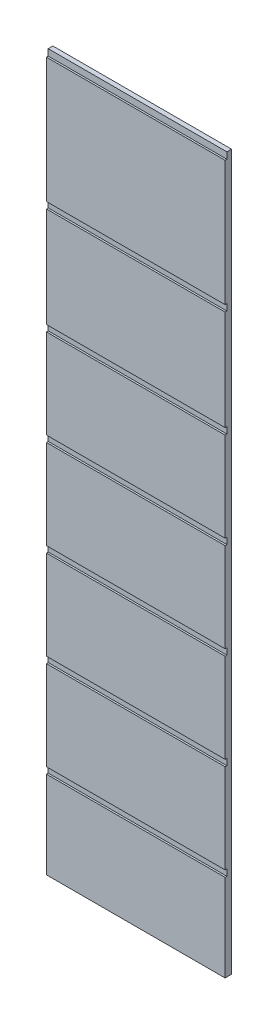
ISO-10303-21;
HEADER;
FILE_DESCRIPTION(('STEP AP214'),'2;1');
FILE_NAME('part.step','',(''),(''),'','','');
FILE_SCHEMA(('AUTOMOTIVE_DESIGN { 1 0 10303 214 1 1 1 1 }'));
ENDSEC;
DATA;
#1=APPLICATION_CONTEXT('core data for automotive mechanical design processes');
#2=APPLICATION_PROTOCOL_DEFINITION('international standard','automotive_design',2000,#1);
#3=PRODUCT_CONTEXT('',#1,'mechanical');
#4=PRODUCT('Part','Part','',(#3));
#5=PRODUCT_RELATED_PRODUCT_CATEGORY('part','',(#4));
#6=PRODUCT_DEFINITION_FORMATION('','',#4);
#7=PRODUCT_DEFINITION_CONTEXT('part definition',#1,'design');
#8=PRODUCT_DEFINITION('design','',#6,#7);
#9=PRODUCT_DEFINITION_SHAPE('','',#8);
#10=(LENGTH_UNIT() NAMED_UNIT(*) SI_UNIT(.MILLI.,.METRE.));
#11=(NAMED_UNIT(*) PLANE_ANGLE_UNIT() SI_UNIT($,.RADIAN.));
#12=(NAMED_UNIT(*) SI_UNIT($,.STERADIAN.) SOLID_ANGLE_UNIT());
#13=UNCERTAINTY_MEASURE_WITH_UNIT(LENGTH_MEASURE(1.E-05),#10,'distance_accuracy_value','');
#14=(GEOMETRIC_REPRESENTATION_CONTEXT(3) GLOBAL_UNCERTAINTY_ASSIGNED_CONTEXT((#13)) GLOBAL_UNIT_ASSIGNED_CONTEXT((#10,
#11,#12)) REPRESENTATION_CONTEXT('',''));
#15=CARTESIAN_POINT('',(0.,0.,0.));
#16=DIRECTION('',(0.,0.,1.));
#17=DIRECTION('',(1.,0.,0.));
#18=AXIS2_PLACEMENT_3D('',#15,#16,#17);
#19=CARTESIAN_POINT('',(0.,0.,9.));
#20=DIRECTION('',(0.,0.,1.));
#21=DIRECTION('',(1.,0.,0.));
#22=AXIS2_PLACEMENT_3D('',#19,#20,#21);
#23=PLANE('',#22);
#24=DIRECTION('',(-1.,0.,0.));
#25=VECTOR('',#24,1.);
#26=CARTESIAN_POINT('',(-249.999999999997,632.,9.));
#27=LINE('',#26,#25);
#28=CARTESIAN_POINT('',(250.000000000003,632.,9.));
#29=VERTEX_POINT('',#28);
#30=CARTESIAN_POINT('',(-249.999999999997,632.,9.));
#31=VERTEX_POINT('',#30);
#32=EDGE_CURVE('E247',#29,#31,#27,.T.);
#33=ORIENTED_EDGE('',*,*,#32,.F.);
#34=DIRECTION('',(0.,1.,0.));
#35=VECTOR('',#34,1.);
#36=CARTESIAN_POINT('',(250.000000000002,1000.,9.));
#37=LINE('',#36,#35);
#38=CARTESIAN_POINT('',(250.000000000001,982.,9.));
#39=VERTEX_POINT('',#38);
#40=EDGE_CURVE('E405',#29,#39,#37,.T.);
#41=ORIENTED_EDGE('',*,*,#40,.T.);
#42=DIRECTION('',(1.,0.,0.));
#43=VECTOR('',#42,1.);
#44=CARTESIAN_POINT('',(-249.999999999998,982.,9.));
#45=LINE('',#44,#43);
#46=CARTESIAN_POINT('',(-249.999999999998,982.,9.));
#47=VERTEX_POINT('',#46);
#48=EDGE_CURVE('E380',#47,#39,#45,.T.);
#49=ORIENTED_EDGE('',*,*,#48,.F.);
#50=DIRECTION('',(0.,-1.,0.));
#51=VECTOR('',#50,1.);
#52=CARTESIAN_POINT('',(-249.999999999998,1000.,9.));
#53=LINE('',#52,#51);
#54=EDGE_CURVE('E399',#47,#31,#53,.T.);
#55=ORIENTED_EDGE('',*,*,#54,.T.);
#56=EDGE_LOOP('',(#33,#41,#49,#55));
#57=FACE_BOUND('',#56,.T.);
#58=ADVANCED_FACE('F32',(#57),#23,.T.);
#59=DIRECTION('',(1.,0.,0.));
#60=VECTOR('',#59,1.);
#61=CARTESIAN_POINT('',(-249.999999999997,614.,9.));
#62=LINE('',#61,#60);
#63=CARTESIAN_POINT('',(-249.999999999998,614.,9.));
#64=VERTEX_POINT('',#63);
#65=CARTESIAN_POINT('',(250.000000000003,614.,9.));
#66=VERTEX_POINT('',#65);
#67=EDGE_CURVE('E278',#64,#66,#62,.T.);
#68=ORIENTED_EDGE('',*,*,#67,.F.);
#69=CARTESIAN_POINT('',(-249.999999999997,334.,9.));
#70=VERTEX_POINT('',#69);
#71=EDGE_CURVE('E252',#64,#70,#53,.T.);
#72=ORIENTED_EDGE('',*,*,#71,.T.);
#73=DIRECTION('',(-1.,0.,0.));
#74=VECTOR('',#73,1.);
#75=CARTESIAN_POINT('',(-249.999999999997,334.,9.));
#76=LINE('',#75,#74);
#77=CARTESIAN_POINT('',(250.000000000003,334.,9.));
#78=VERTEX_POINT('',#77);
#79=EDGE_CURVE('E263',#78,#70,#76,.T.);
#80=ORIENTED_EDGE('',*,*,#79,.F.);
#81=EDGE_CURVE('E477',#78,#66,#37,.T.);
#82=ORIENTED_EDGE('',*,*,#81,.T.);
#83=EDGE_LOOP('',(#68,#72,#80,#82));
#84=FACE_BOUND('',#83,.T.);
#85=ADVANCED_FACE('F474',(#84),#23,.T.);
#86=DIRECTION('',(1.,0.,0.));
#87=VECTOR('',#86,1.);
#88=CARTESIAN_POINT('',(-249.999999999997,316.,9.));
#89=LINE('',#88,#87);
#90=CARTESIAN_POINT('',(-249.999999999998,316.,9.));
#91=VERTEX_POINT('',#90);
#92=CARTESIAN_POINT('',(250.000000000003,316.,9.));
#93=VERTEX_POINT('',#92);
#94=EDGE_CURVE('E272',#91,#93,#89,.T.);
#95=ORIENTED_EDGE('',*,*,#94,.F.);
#96=CARTESIAN_POINT('',(-249.999999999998,66.0000000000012,9.));
#97=VERTEX_POINT('',#96);
#98=EDGE_CURVE('E462',#91,#97,#53,.T.);
#99=ORIENTED_EDGE('',*,*,#98,.T.);
#100=DIRECTION('',(-1.,0.,0.));
#101=VECTOR('',#100,1.);
#102=CARTESIAN_POINT('',(-250.189841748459,66.0000000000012,9.));
#103=LINE('',#102,#101);
#104=CARTESIAN_POINT('',(250.000000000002,66.0000000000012,9.));
#105=VERTEX_POINT('',#104);
#106=EDGE_CURVE('E288',#105,#97,#103,.T.);
#107=ORIENTED_EDGE('',*,*,#106,.F.);
#108=EDGE_CURVE('E489',#105,#93,#37,.T.);
#109=ORIENTED_EDGE('',*,*,#108,.T.);
#110=EDGE_LOOP('',(#95,#99,#107,#109));
#111=FACE_BOUND('',#110,.T.);
#112=ADVANCED_FACE('F533',(#111),#23,.T.);
#113=DIRECTION('',(1.,0.,0.));
#114=VECTOR('',#113,1.);
#115=CARTESIAN_POINT('',(0.,47.9999999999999,9.));
#116=LINE('',#115,#114);
#117=CARTESIAN_POINT('',(-249.999999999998,47.9999999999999,9.));
#118=VERTEX_POINT('',#117);
#119=CARTESIAN_POINT('',(250.000000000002,47.9999999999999,9.));
#120=VERTEX_POINT('',#119);
#121=EDGE_CURVE('E11',#118,#120,#116,.T.);
#122=ORIENTED_EDGE('',*,*,#121,.F.);
#123=CARTESIAN_POINT('',(-249.999999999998,-202.,9.));
#124=VERTEX_POINT('',#123);
#125=EDGE_CURVE('E456',#118,#124,#53,.T.);
#126=ORIENTED_EDGE('',*,*,#125,.T.);
#127=DIRECTION('',(-1.,0.,0.));
#128=VECTOR('',#127,1.);
#129=CARTESIAN_POINT('',(-249.999999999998,-202.,9.));
#130=LINE('',#129,#128);
#131=CARTESIAN_POINT('',(250.000000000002,-202.,9.));
#132=VERTEX_POINT('',#131);
#133=EDGE_CURVE('E303',#132,#124,#130,.T.);
#134=ORIENTED_EDGE('',*,*,#133,.F.);
#135=EDGE_CURVE('E491',#132,#120,#37,.T.);
#136=ORIENTED_EDGE('',*,*,#135,.T.);
#137=EDGE_LOOP('',(#122,#126,#134,#136));
#138=FACE_BOUND('',#137,.T.);
#139=ADVANCED_FACE('F553',(#138),#23,.T.);
#140=DIRECTION('',(1.,0.,0.));
#141=VECTOR('',#140,1.);
#142=CARTESIAN_POINT('',(-249.999999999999,-220.,9.));
#143=LINE('',#142,#141);
#144=CARTESIAN_POINT('',(-249.999999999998,-220.,9.));
#145=VERTEX_POINT('',#144);
#146=CARTESIAN_POINT('',(250.000000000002,-220.,9.));
#147=VERTEX_POINT('',#146);
#148=EDGE_CURVE('E312',#145,#147,#143,.T.);
#149=ORIENTED_EDGE('',*,*,#148,.F.);
#150=CARTESIAN_POINT('',(-249.999999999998,-470.,9.));
#151=VERTEX_POINT('',#150);
#152=EDGE_CURVE('E451',#145,#151,#53,.T.);
#153=ORIENTED_EDGE('',*,*,#152,.T.);
#154=DIRECTION('',(-1.,0.,0.));
#155=VECTOR('',#154,1.);
#156=CARTESIAN_POINT('',(-249.999999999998,-470.,9.));
#157=LINE('',#156,#155);
#158=CARTESIAN_POINT('',(250.000000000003,-470.,9.));
#159=VERTEX_POINT('',#158);
#160=EDGE_CURVE('E328',#159,#151,#157,.T.);
#161=ORIENTED_EDGE('',*,*,#160,.F.);
#162=EDGE_CURVE('E494',#159,#147,#37,.T.);
#163=ORIENTED_EDGE('',*,*,#162,.T.);
#164=EDGE_LOOP('',(#149,#153,#161,#163));
#165=FACE_BOUND('',#164,.T.);
#166=ADVANCED_FACE('F546',(#165),#23,.T.);
#167=DIRECTION('',(1.,0.,0.));
#168=VECTOR('',#167,1.);
#169=CARTESIAN_POINT('',(-249.999999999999,-488.,9.));
#170=LINE('',#169,#168);
#171=CARTESIAN_POINT('',(-249.999999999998,-488.,9.));
#172=VERTEX_POINT('',#171);
#173=CARTESIAN_POINT('',(250.000000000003,-488.,9.));
#174=VERTEX_POINT('',#173);
#175=EDGE_CURVE('E336',#172,#174,#170,.T.);
#176=ORIENTED_EDGE('',*,*,#175,.F.);
#177=CARTESIAN_POINT('',(-249.999999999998,-738.,9.));
#178=VERTEX_POINT('',#177);
#179=EDGE_CURVE('E449',#172,#178,#53,.T.);
#180=ORIENTED_EDGE('',*,*,#179,.T.);
#181=DIRECTION('',(-1.,0.,0.));
#182=VECTOR('',#181,1.);
#183=CARTESIAN_POINT('',(-249.999999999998,-738.,9.));
#184=LINE('',#183,#182);
#185=CARTESIAN_POINT('',(250.000000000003,-738.,9.));
#186=VERTEX_POINT('',#185);
#187=EDGE_CURVE('E352',#186,#178,#184,.T.);
#188=ORIENTED_EDGE('',*,*,#187,.F.);
#189=EDGE_CURVE('E410',#186,#174,#37,.T.);
#190=ORIENTED_EDGE('',*,*,#189,.T.);
#191=EDGE_LOOP('',(#176,#180,#188,#190));
#192=FACE_BOUND('',#191,.T.);
#193=ADVANCED_FACE('F500',(#192),#23,.T.);
#194=CARTESIAN_POINT('',(-249.999999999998,1000.,9.));
#195=DIRECTION('',(0.,-1.,0.));
#196=DIRECTION('',(0.,0.,-1.));
#197=AXIS2_PLACEMENT_3D('',#194,#195,#196);
#198=PLANE('',#197);
#199=DIRECTION('',(-1.,0.,0.));
#200=VECTOR('',#199,1.);
#201=CARTESIAN_POINT('',(-249.999999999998,1000.,4.));
#202=LINE('',#201,#200);
#203=CARTESIAN_POINT('',(250.000000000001,1000.,4.));
#204=VERTEX_POINT('',#203);
#205=CARTESIAN_POINT('',(-249.999999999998,1000.,4.));
#206=VERTEX_POINT('',#205);
#207=EDGE_CURVE('E389',#204,#206,#202,.T.);
#208=ORIENTED_EDGE('',*,*,#207,.F.);
#209=DIRECTION('',(0.,0.,-1.));
#210=VECTOR('',#209,1.);
#211=CARTESIAN_POINT('',(250.000000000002,1000.,9.));
#212=LINE('',#211,#210);
#213=CARTESIAN_POINT('',(250.000000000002,1000.,-9.));
#214=VERTEX_POINT('',#213);
#215=EDGE_CURVE('E422',#204,#214,#212,.T.);
#216=ORIENTED_EDGE('',*,*,#215,.T.);
#217=DIRECTION('',(-1.,0.,0.));
#218=VECTOR('',#217,1.);
#219=CARTESIAN_POINT('',(-249.999999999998,1000.,-9.));
#220=LINE('',#219,#218);
#221=CARTESIAN_POINT('',(-249.999999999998,1000.,-9.));
#222=VERTEX_POINT('',#221);
#223=EDGE_CURVE('E418',#214,#222,#220,.T.);
#224=ORIENTED_EDGE('',*,*,#223,.T.);
#225=DIRECTION('',(0.,0.,-1.));
#226=VECTOR('',#225,1.);
#227=CARTESIAN_POINT('',(-249.999999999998,1000.,9.));
#228=LINE('',#227,#226);
#229=EDGE_CURVE('E409',#206,#222,#228,.T.);
#230=ORIENTED_EDGE('',*,*,#229,.F.);
#231=EDGE_LOOP('',(#208,#216,#224,#230));
#232=FACE_BOUND('',#231,.T.);
#233=ADVANCED_FACE('F545',(#232),#198,.F.);
#234=CARTESIAN_POINT('',(-249.999999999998,1000.,9.));
#235=DIRECTION('',(1.,0.,0.));
#236=DIRECTION('',(0.,0.,-1.));
#237=AXIS2_PLACEMENT_3D('',#234,#235,#236);
#238=PLANE('',#237);
#239=DIRECTION('',(0.,-1.,0.));
#240=VECTOR('',#239,1.);
#241=CARTESIAN_POINT('',(-249.999999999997,632.,4.));
#242=LINE('',#241,#240);
#243=CARTESIAN_POINT('',(-249.999999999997,632.,4.));
#244=VERTEX_POINT('',#243);
#245=CARTESIAN_POINT('',(-249.999999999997,614.,4.));
#246=VERTEX_POINT('',#245);
#247=EDGE_CURVE('E238',#244,#246,#242,.T.);
#248=ORIENTED_EDGE('',*,*,#247,.F.);
#249=DIRECTION('',(0.,0.,1.));
#250=VECTOR('',#249,1.);
#251=CARTESIAN_POINT('',(-249.999999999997,632.,4.));
#252=LINE('',#251,#250);
#253=EDGE_CURVE('E375',#244,#31,#252,.T.);
#254=ORIENTED_EDGE('',*,*,#253,.T.);
#255=ORIENTED_EDGE('',*,*,#54,.F.);
#256=DIRECTION('',(0.,0.,1.));
#257=VECTOR('',#256,1.);
#258=CARTESIAN_POINT('',(-249.999999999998,982.,4.));
#259=LINE('',#258,#257);
#260=CARTESIAN_POINT('',(-249.999999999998,982.,4.));
#261=VERTEX_POINT('',#260);
#262=EDGE_CURVE('E391',#261,#47,#259,.T.);
#263=ORIENTED_EDGE('',*,*,#262,.F.);
#264=DIRECTION('',(0.,-1.,0.));
#265=VECTOR('',#264,1.);
#266=CARTESIAN_POINT('',(-249.999999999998,1000.,4.));
#267=LINE('',#266,#265);
#268=EDGE_CURVE('E381',#206,#261,#267,.T.);
#269=ORIENTED_EDGE('',*,*,#268,.F.);
#270=ORIENTED_EDGE('',*,*,#229,.T.);
#271=DIRECTION('',(0.,-1.,0.));
#272=VECTOR('',#271,1.);
#273=CARTESIAN_POINT('',(-249.999999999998,1000.,-9.));
#274=LINE('',#273,#272);
#275=CARTESIAN_POINT('',(-249.999999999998,-1000.,-9.));
#276=VERTEX_POINT('',#275);
#277=EDGE_CURVE('E397',#222,#276,#274,.T.);
#278=ORIENTED_EDGE('',*,*,#277,.T.);
#279=DIRECTION('',(0.,0.,-1.));
#280=VECTOR('',#279,1.);
#281=CARTESIAN_POINT('',(-249.999999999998,-1000.,9.));
#282=LINE('',#281,#280);
#283=CARTESIAN_POINT('',(-249.999999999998,-1000.,9.));
#284=VERTEX_POINT('',#283);
#285=EDGE_CURVE('E40',#284,#276,#282,.T.);
#286=ORIENTED_EDGE('',*,*,#285,.F.);
#287=CARTESIAN_POINT('',(-249.999999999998,-756.,9.));
#288=VERTEX_POINT('',#287);
#289=EDGE_CURVE('E403',#288,#284,#53,.T.);
#290=ORIENTED_EDGE('',*,*,#289,.F.);
#291=DIRECTION('',(0.,0.,1.));
#292=VECTOR('',#291,1.);
#293=CARTESIAN_POINT('',(-249.999999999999,-756.,4.));
#294=LINE('',#293,#292);
#295=CARTESIAN_POINT('',(-249.999999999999,-756.,4.));
#296=VERTEX_POINT('',#295);
#297=EDGE_CURVE('E47',#296,#288,#294,.T.);
#298=ORIENTED_EDGE('',*,*,#297,.F.);
#299=DIRECTION('',(0.,-1.,0.));
#300=VECTOR('',#299,1.);
#301=CARTESIAN_POINT('',(-249.999999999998,-738.,4.));
#302=LINE('',#301,#300);
#303=CARTESIAN_POINT('',(-249.999999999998,-738.,4.));
#304=VERTEX_POINT('',#303);
#305=EDGE_CURVE('E348',#304,#296,#302,.T.);
#306=ORIENTED_EDGE('',*,*,#305,.F.);
#307=DIRECTION('',(0.,0.,1.));
#308=VECTOR('',#307,1.);
#309=CARTESIAN_POINT('',(-249.999999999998,-738.,4.));
#310=LINE('',#309,#308);
#311=EDGE_CURVE('E338',#304,#178,#310,.T.);
#312=ORIENTED_EDGE('',*,*,#311,.T.);
#313=ORIENTED_EDGE('',*,*,#179,.F.);
#314=DIRECTION('',(0.,0.,1.));
#315=VECTOR('',#314,1.);
#316=CARTESIAN_POINT('',(-249.999999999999,-488.,4.));
#317=LINE('',#316,#315);
#318=CARTESIAN_POINT('',(-249.999999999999,-488.,4.));
#319=VERTEX_POINT('',#318);
#320=EDGE_CURVE('E55',#319,#172,#317,.T.);
#321=ORIENTED_EDGE('',*,*,#320,.F.);
#322=DIRECTION('',(0.,-1.,0.));
#323=VECTOR('',#322,1.);
#324=CARTESIAN_POINT('',(-249.999999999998,-470.,4.));
#325=LINE('',#324,#323);
#326=CARTESIAN_POINT('',(-249.999999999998,-470.,4.));
#327=VERTEX_POINT('',#326);
#328=EDGE_CURVE('E324',#327,#319,#325,.T.);
#329=ORIENTED_EDGE('',*,*,#328,.F.);
#330=DIRECTION('',(0.,0.,1.));
#331=VECTOR('',#330,1.);
#332=CARTESIAN_POINT('',(-249.999999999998,-470.,4.));
#333=LINE('',#332,#331);
#334=EDGE_CURVE('E314',#327,#151,#333,.T.);
#335=ORIENTED_EDGE('',*,*,#334,.T.);
#336=ORIENTED_EDGE('',*,*,#152,.F.);
#337=DIRECTION('',(0.,0.,1.));
#338=VECTOR('',#337,1.);
#339=CARTESIAN_POINT('',(-249.999999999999,-220.,4.));
#340=LINE('',#339,#338);
#341=CARTESIAN_POINT('',(-249.999999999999,-220.,4.));
#342=VERTEX_POINT('',#341);
#343=EDGE_CURVE('E311',#342,#145,#340,.T.);
#344=ORIENTED_EDGE('',*,*,#343,.F.);
#345=DIRECTION('',(0.,-1.,0.));
#346=VECTOR('',#345,1.);
#347=CARTESIAN_POINT('',(-249.999999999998,-202.,4.));
#348=LINE('',#347,#346);
#349=CARTESIAN_POINT('',(-249.999999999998,-202.,4.));
#350=VERTEX_POINT('',#349);
#351=EDGE_CURVE('E299',#350,#342,#348,.T.);
#352=ORIENTED_EDGE('',*,*,#351,.F.);
#353=DIRECTION('',(0.,0.,1.));
#354=VECTOR('',#353,1.);
#355=CARTESIAN_POINT('',(-249.999999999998,-202.,4.));
#356=LINE('',#355,#354);
#357=EDGE_CURVE('E295',#350,#124,#356,.T.);
#358=ORIENTED_EDGE('',*,*,#357,.T.);
#359=ORIENTED_EDGE('',*,*,#125,.F.);
#360=DIRECTION('',(0.,0.,-1.));
#361=VECTOR('',#360,1.);
#362=CARTESIAN_POINT('',(-249.999999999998,47.9999999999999,9.));
#363=LINE('',#362,#361);
#364=CARTESIAN_POINT('',(-249.999999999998,47.9999999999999,4.));
#365=VERTEX_POINT('',#364);
#366=EDGE_CURVE('E371',#118,#365,#363,.T.);
#367=ORIENTED_EDGE('',*,*,#366,.T.);
#368=DIRECTION('',(0.,-1.,0.));
#369=VECTOR('',#368,1.);
#370=CARTESIAN_POINT('',(-249.999999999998,1000.,4.));
#371=LINE('',#370,#369);
#372=CARTESIAN_POINT('',(-249.999999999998,66.0000000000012,4.));
#373=VERTEX_POINT('',#372);
#374=EDGE_CURVE('E378',#373,#365,#371,.T.);
#375=ORIENTED_EDGE('',*,*,#374,.F.);
#376=DIRECTION('',(0.,0.,1.));
#377=VECTOR('',#376,1.);
#378=CARTESIAN_POINT('',(-249.999999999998,66.0000000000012,9.));
#379=LINE('',#378,#377);
#380=EDGE_CURVE('E374',#373,#97,#379,.T.);
#381=ORIENTED_EDGE('',*,*,#380,.T.);
#382=ORIENTED_EDGE('',*,*,#98,.F.);
#383=DIRECTION('',(0.,0.,1.));
#384=VECTOR('',#383,1.);
#385=CARTESIAN_POINT('',(-249.999999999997,316.,4.));
#386=LINE('',#385,#384);
#387=CARTESIAN_POINT('',(-249.999999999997,316.,4.));
#388=VERTEX_POINT('',#387);
#389=EDGE_CURVE('E271',#388,#91,#386,.T.);
#390=ORIENTED_EDGE('',*,*,#389,.F.);
#391=DIRECTION('',(0.,-1.,0.));
#392=VECTOR('',#391,1.);
#393=CARTESIAN_POINT('',(-249.999999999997,334.,4.));
#394=LINE('',#393,#392);
#395=CARTESIAN_POINT('',(-249.999999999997,334.,4.));
#396=VERTEX_POINT('',#395);
#397=EDGE_CURVE('E259',#396,#388,#394,.T.);
#398=ORIENTED_EDGE('',*,*,#397,.F.);
#399=DIRECTION('',(0.,0.,1.));
#400=VECTOR('',#399,1.);
#401=CARTESIAN_POINT('',(-249.999999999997,334.,4.));
#402=LINE('',#401,#400);
#403=EDGE_CURVE('E276',#396,#70,#402,.T.);
#404=ORIENTED_EDGE('',*,*,#403,.T.);
#405=ORIENTED_EDGE('',*,*,#71,.F.);
#406=DIRECTION('',(0.,0.,1.));
#407=VECTOR('',#406,1.);
#408=CARTESIAN_POINT('',(-249.999999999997,614.,4.));
#409=LINE('',#408,#407);
#410=EDGE_CURVE('E231',#246,#64,#409,.T.);
#411=ORIENTED_EDGE('',*,*,#410,.F.);
#412=EDGE_LOOP('',(#248,#254,#255,#263,#269,#270,#278,#286,#290,#298,#306,#312,#313,#321,#329,
#335,#336,#344,#352,#358,#359,#367,#375,#381,#382,#390,#398,#404,#405,#411));
#413=FACE_BOUND('',#412,.T.);
#414=ADVANCED_FACE('F34',(#413),#238,.F.);
#415=CARTESIAN_POINT('',(-249.999999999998,-1000.,9.));
#416=DIRECTION('',(0.,1.,0.));
#417=DIRECTION('',(0.,0.,1.));
#418=AXIS2_PLACEMENT_3D('',#415,#416,#417);
#419=PLANE('',#418);
#420=DIRECTION('',(1.,0.,0.));
#421=VECTOR('',#420,1.);
#422=CARTESIAN_POINT('',(-249.999999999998,-1000.,-9.));
#423=LINE('',#422,#421);
#424=CARTESIAN_POINT('',(250.000000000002,-1000.,-9.));
#425=VERTEX_POINT('',#424);
#426=EDGE_CURVE('E413',#276,#425,#423,.T.);
#427=ORIENTED_EDGE('',*,*,#426,.T.);
#428=DIRECTION('',(0.,0.,-1.));
#429=VECTOR('',#428,1.);
#430=CARTESIAN_POINT('',(250.000000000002,-1000.,9.));
#431=LINE('',#430,#429);
#432=CARTESIAN_POINT('',(250.000000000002,-1000.,9.));
#433=VERTEX_POINT('',#432);
#434=EDGE_CURVE('E424',#433,#425,#431,.T.);
#435=ORIENTED_EDGE('',*,*,#434,.F.);
#436=DIRECTION('',(1.,0.,0.));
#437=VECTOR('',#436,1.);
#438=CARTESIAN_POINT('',(-249.999999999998,-1000.,9.));
#439=LINE('',#438,#437);
#440=EDGE_CURVE('E402',#284,#433,#439,.T.);
#441=ORIENTED_EDGE('',*,*,#440,.F.);
#442=ORIENTED_EDGE('',*,*,#285,.T.);
#443=EDGE_LOOP('',(#427,#435,#441,#442));
#444=FACE_BOUND('',#443,.T.);
#445=ADVANCED_FACE('F430',(#444),#419,.F.);
#446=CARTESIAN_POINT('',(250.000000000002,1000.,9.));
#447=DIRECTION('',(-1.,0.,0.));
#448=DIRECTION('',(0.,0.,1.));
#449=AXIS2_PLACEMENT_3D('',#446,#447,#448);
#450=PLANE('',#449);
#451=ORIENTED_EDGE('',*,*,#40,.F.);
#452=DIRECTION('',(0.,0.,1.));
#453=VECTOR('',#452,1.);
#454=CARTESIAN_POINT('',(250.000000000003,632.,4.));
#455=LINE('',#454,#453);
#456=CARTESIAN_POINT('',(250.000000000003,632.,4.));
#457=VERTEX_POINT('',#456);
#458=EDGE_CURVE('E254',#457,#29,#455,.T.);
#459=ORIENTED_EDGE('',*,*,#458,.F.);
#460=DIRECTION('',(0.,1.,0.));
#461=VECTOR('',#460,1.);
#462=CARTESIAN_POINT('',(250.000000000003,632.,4.));
#463=LINE('',#462,#461);
#464=CARTESIAN_POINT('',(250.000000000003,614.,4.));
#465=VERTEX_POINT('',#464);
#466=EDGE_CURVE('E237',#465,#457,#463,.T.);
#467=ORIENTED_EDGE('',*,*,#466,.F.);
#468=DIRECTION('',(0.,0.,1.));
#469=VECTOR('',#468,1.);
#470=CARTESIAN_POINT('',(250.000000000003,614.,4.));
#471=LINE('',#470,#469);
#472=EDGE_CURVE('E234',#465,#66,#471,.T.);
#473=ORIENTED_EDGE('',*,*,#472,.T.);
#474=ORIENTED_EDGE('',*,*,#81,.F.);
#475=DIRECTION('',(0.,0.,1.));
#476=VECTOR('',#475,1.);
#477=CARTESIAN_POINT('',(250.000000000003,334.,4.));
#478=LINE('',#477,#476);
#479=CARTESIAN_POINT('',(250.000000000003,334.,4.));
#480=VERTEX_POINT('',#479);
#481=EDGE_CURVE('E279',#480,#78,#478,.T.);
#482=ORIENTED_EDGE('',*,*,#481,.F.);
#483=DIRECTION('',(0.,1.,0.));
#484=VECTOR('',#483,1.);
#485=CARTESIAN_POINT('',(250.000000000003,334.,4.));
#486=LINE('',#485,#484);
#487=CARTESIAN_POINT('',(250.000000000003,316.,4.));
#488=VERTEX_POINT('',#487);
#489=EDGE_CURVE('E266',#488,#480,#486,.T.);
#490=ORIENTED_EDGE('',*,*,#489,.F.);
#491=DIRECTION('',(0.,0.,1.));
#492=VECTOR('',#491,1.);
#493=CARTESIAN_POINT('',(250.000000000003,316.,4.));
#494=LINE('',#493,#492);
#495=EDGE_CURVE('E281',#488,#93,#494,.T.);
#496=ORIENTED_EDGE('',*,*,#495,.T.);
#497=ORIENTED_EDGE('',*,*,#108,.F.);
#498=DIRECTION('',(0.,0.,1.));
#499=VECTOR('',#498,1.);
#500=CARTESIAN_POINT('',(250.000000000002,66.0000000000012,4.));
#501=LINE('',#500,#499);
#502=CARTESIAN_POINT('',(250.000000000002,66.0000000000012,4.));
#503=VERTEX_POINT('',#502);
#504=EDGE_CURVE('E274',#503,#105,#501,.T.);
#505=ORIENTED_EDGE('',*,*,#504,.F.);
#506=DIRECTION('',(0.,1.,0.));
#507=VECTOR('',#506,1.);
#508=CARTESIAN_POINT('',(250.000000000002,66.0000000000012,4.));
#509=LINE('',#508,#507);
#510=CARTESIAN_POINT('',(250.000000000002,47.9999999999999,4.));
#511=VERTEX_POINT('',#510);
#512=EDGE_CURVE('E287',#511,#503,#509,.T.);
#513=ORIENTED_EDGE('',*,*,#512,.F.);
#514=DIRECTION('',(0.,0.,1.));
#515=VECTOR('',#514,1.);
#516=CARTESIAN_POINT('',(250.000000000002,47.9999999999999,4.));
#517=LINE('',#516,#515);
#518=EDGE_CURVE('E293',#511,#120,#517,.T.);
#519=ORIENTED_EDGE('',*,*,#518,.T.);
#520=ORIENTED_EDGE('',*,*,#135,.F.);
#521=DIRECTION('',(0.,0.,1.));
#522=VECTOR('',#521,1.);
#523=CARTESIAN_POINT('',(250.000000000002,-202.,4.));
#524=LINE('',#523,#522);
#525=CARTESIAN_POINT('',(250.000000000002,-202.,4.));
#526=VERTEX_POINT('',#525);
#527=EDGE_CURVE('E318',#526,#132,#524,.T.);
#528=ORIENTED_EDGE('',*,*,#527,.F.);
#529=DIRECTION('',(0.,1.,0.));
#530=VECTOR('',#529,1.);
#531=CARTESIAN_POINT('',(250.000000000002,-202.,4.));
#532=LINE('',#531,#530);
#533=CARTESIAN_POINT('',(250.000000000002,-220.,4.));
#534=VERTEX_POINT('',#533);
#535=EDGE_CURVE('E306',#534,#526,#532,.T.);
#536=ORIENTED_EDGE('',*,*,#535,.F.);
#537=DIRECTION('',(0.,0.,1.));
#538=VECTOR('',#537,1.);
#539=CARTESIAN_POINT('',(250.000000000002,-220.,4.));
#540=LINE('',#539,#538);
#541=EDGE_CURVE('E320',#534,#147,#540,.T.);
#542=ORIENTED_EDGE('',*,*,#541,.T.);
#543=ORIENTED_EDGE('',*,*,#162,.F.);
#544=DIRECTION('',(0.,0.,1.));
#545=VECTOR('',#544,1.);
#546=CARTESIAN_POINT('',(250.000000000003,-470.,4.));
#547=LINE('',#546,#545);
#548=CARTESIAN_POINT('',(250.000000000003,-470.,4.));
#549=VERTEX_POINT('',#548);
#550=EDGE_CURVE('E342',#549,#159,#547,.T.);
#551=ORIENTED_EDGE('',*,*,#550,.F.);
#552=DIRECTION('',(0.,1.,0.));
#553=VECTOR('',#552,1.);
#554=CARTESIAN_POINT('',(250.000000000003,-470.,4.));
#555=LINE('',#554,#553);
#556=CARTESIAN_POINT('',(250.000000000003,-488.,4.));
#557=VERTEX_POINT('',#556);
#558=EDGE_CURVE('E331',#557,#549,#555,.T.);
#559=ORIENTED_EDGE('',*,*,#558,.F.);
#560=DIRECTION('',(0.,0.,1.));
#561=VECTOR('',#560,1.);
#562=CARTESIAN_POINT('',(250.000000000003,-488.,4.));
#563=LINE('',#562,#561);
#564=EDGE_CURVE('E344',#557,#174,#563,.T.);
#565=ORIENTED_EDGE('',*,*,#564,.T.);
#566=ORIENTED_EDGE('',*,*,#189,.F.);
#567=DIRECTION('',(0.,0.,1.));
#568=VECTOR('',#567,1.);
#569=CARTESIAN_POINT('',(250.000000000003,-738.,4.));
#570=LINE('',#569,#568);
#571=CARTESIAN_POINT('',(250.000000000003,-738.,4.));
#572=VERTEX_POINT('',#571);
#573=EDGE_CURVE('E365',#572,#186,#570,.T.);
#574=ORIENTED_EDGE('',*,*,#573,.F.);
#575=DIRECTION('',(0.,1.,0.));
#576=VECTOR('',#575,1.);
#577=CARTESIAN_POINT('',(250.000000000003,-738.,4.));
#578=LINE('',#577,#576);
#579=CARTESIAN_POINT('',(250.000000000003,-756.,4.));
#580=VERTEX_POINT('',#579);
#581=EDGE_CURVE('E355',#580,#572,#578,.T.);
#582=ORIENTED_EDGE('',*,*,#581,.F.);
#583=DIRECTION('',(0.,0.,1.));
#584=VECTOR('',#583,1.);
#585=CARTESIAN_POINT('',(250.000000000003,-756.,4.));
#586=LINE('',#585,#584);
#587=CARTESIAN_POINT('',(250.000000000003,-756.,9.));
#588=VERTEX_POINT('',#587);
#589=EDGE_CURVE('E367',#580,#588,#586,.T.);
#590=ORIENTED_EDGE('',*,*,#589,.T.);
#591=EDGE_CURVE('E406',#433,#588,#37,.T.);
#592=ORIENTED_EDGE('',*,*,#591,.F.);
#593=ORIENTED_EDGE('',*,*,#434,.T.);
#594=DIRECTION('',(0.,1.,0.));
#595=VECTOR('',#594,1.);
#596=CARTESIAN_POINT('',(250.000000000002,1000.,-9.));
#597=LINE('',#596,#595);
#598=EDGE_CURVE('E415',#425,#214,#597,.T.);
#599=ORIENTED_EDGE('',*,*,#598,.T.);
#600=ORIENTED_EDGE('',*,*,#215,.F.);
#601=DIRECTION('',(0.,1.,0.));
#602=VECTOR('',#601,1.);
#603=CARTESIAN_POINT('',(250.000000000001,1000.,4.));
#604=LINE('',#603,#602);
#605=CARTESIAN_POINT('',(250.000000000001,982.,4.));
#606=VERTEX_POINT('',#605);
#607=EDGE_CURVE('E387',#606,#204,#604,.T.);
#608=ORIENTED_EDGE('',*,*,#607,.F.);
#609=DIRECTION('',(0.,0.,1.));
#610=VECTOR('',#609,1.);
#611=CARTESIAN_POINT('',(250.000000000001,982.,4.));
#612=LINE('',#611,#610);
#613=EDGE_CURVE('E394',#606,#39,#612,.T.);
#614=ORIENTED_EDGE('',*,*,#613,.T.);
#615=EDGE_LOOP('',(#451,#459,#467,#473,#474,#482,#490,#496,#497,#505,#513,#519,#520,#528,#536,
#542,#543,#551,#559,#565,#566,#574,#582,#590,#592,#593,#599,#600,#608,#614));
#616=FACE_BOUND('',#615,.T.);
#617=ADVANCED_FACE('F443',(#616),#450,.F.);
#618=DIRECTION('',(1.,0.,0.));
#619=VECTOR('',#618,1.);
#620=CARTESIAN_POINT('',(-249.999999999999,-756.,9.));
#621=LINE('',#620,#619);
#622=EDGE_CURVE('E360',#288,#588,#621,.T.);
#623=ORIENTED_EDGE('',*,*,#622,.F.);
#624=ORIENTED_EDGE('',*,*,#289,.T.);
#625=ORIENTED_EDGE('',*,*,#440,.T.);
#626=ORIENTED_EDGE('',*,*,#591,.T.);
#627=EDGE_LOOP('',(#623,#624,#625,#626));
#628=FACE_BOUND('',#627,.T.);
#629=ADVANCED_FACE('F448',(#628),#23,.T.);
#630=CARTESIAN_POINT('',(0.,0.,-9.));
#631=DIRECTION('',(0.,0.,1.));
#632=DIRECTION('',(1.,0.,0.));
#633=AXIS2_PLACEMENT_3D('',#630,#631,#632);
#634=PLANE('',#633);
#635=ORIENTED_EDGE('',*,*,#277,.F.);
#636=ORIENTED_EDGE('',*,*,#223,.F.);
#637=ORIENTED_EDGE('',*,*,#598,.F.);
#638=ORIENTED_EDGE('',*,*,#426,.F.);
#639=EDGE_LOOP('',(#635,#636,#637,#638));
#640=FACE_BOUND('',#639,.T.);
#641=ADVANCED_FACE('F438',(#640),#634,.F.);
#642=CARTESIAN_POINT('',(-249.999999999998,982.,4.));
#643=DIRECTION('',(0.,-1.,0.));
#644=DIRECTION('',(0.,0.,-1.));
#645=AXIS2_PLACEMENT_3D('',#642,#643,#644);
#646=PLANE('',#645);
#647=ORIENTED_EDGE('',*,*,#48,.T.);
#648=ORIENTED_EDGE('',*,*,#613,.F.);
#649=DIRECTION('',(1.,0.,0.));
#650=VECTOR('',#649,1.);
#651=CARTESIAN_POINT('',(-249.999999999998,982.,4.));
#652=LINE('',#651,#650);
#653=EDGE_CURVE('E384',#261,#606,#652,.T.);
#654=ORIENTED_EDGE('',*,*,#653,.F.);
#655=ORIENTED_EDGE('',*,*,#262,.T.);
#656=EDGE_LOOP('',(#647,#648,#654,#655));
#657=FACE_BOUND('',#656,.T.);
#658=ADVANCED_FACE('F542',(#657),#646,.F.);
#659=CARTESIAN_POINT('',(0.,0.,4.));
#660=DIRECTION('',(0.,0.,1.));
#661=DIRECTION('',(1.,0.,0.));
#662=AXIS2_PLACEMENT_3D('',#659,#660,#661);
#663=PLANE('',#662);
#664=ORIENTED_EDGE('',*,*,#268,.T.);
#665=ORIENTED_EDGE('',*,*,#653,.T.);
#666=ORIENTED_EDGE('',*,*,#607,.T.);
#667=ORIENTED_EDGE('',*,*,#207,.T.);
#668=EDGE_LOOP('',(#664,#665,#666,#667));
#669=FACE_BOUND('',#668,.T.);
#670=ADVANCED_FACE('F524',(#669),#663,.T.);
#671=CARTESIAN_POINT('',(-249.999999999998,-738.,4.));
#672=DIRECTION('',(0.,1.,0.));
#673=DIRECTION('',(0.,0.,1.));
#674=AXIS2_PLACEMENT_3D('',#671,#672,#673);
#675=PLANE('',#674);
#676=ORIENTED_EDGE('',*,*,#187,.T.);
#677=ORIENTED_EDGE('',*,*,#311,.F.);
#678=DIRECTION('',(-1.,0.,0.));
#679=VECTOR('',#678,1.);
#680=CARTESIAN_POINT('',(-249.999999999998,-738.,4.));
#681=LINE('',#680,#679);
#682=EDGE_CURVE('E357',#572,#304,#681,.T.);
#683=ORIENTED_EDGE('',*,*,#682,.F.);
#684=ORIENTED_EDGE('',*,*,#573,.T.);
#685=EDGE_LOOP('',(#676,#677,#683,#684));
#686=FACE_BOUND('',#685,.T.);
#687=ADVANCED_FACE('F512',(#686),#675,.F.);
#688=CARTESIAN_POINT('',(-249.999999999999,-756.,4.));
#689=DIRECTION('',(0.,-1.,0.));
#690=DIRECTION('',(0.,0.,-1.));
#691=AXIS2_PLACEMENT_3D('',#688,#689,#690);
#692=PLANE('',#691);
#693=ORIENTED_EDGE('',*,*,#622,.T.);
#694=ORIENTED_EDGE('',*,*,#589,.F.);
#695=DIRECTION('',(1.,0.,0.));
#696=VECTOR('',#695,1.);
#697=CARTESIAN_POINT('',(-249.999999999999,-756.,4.));
#698=LINE('',#697,#696);
#699=EDGE_CURVE('E351',#296,#580,#698,.T.);
#700=ORIENTED_EDGE('',*,*,#699,.F.);
#701=ORIENTED_EDGE('',*,*,#297,.T.);
#702=EDGE_LOOP('',(#693,#694,#700,#701));
#703=FACE_BOUND('',#702,.T.);
#704=ADVANCED_FACE('F515',(#703),#692,.F.);
#705=CARTESIAN_POINT('',(0.,0.,4.));
#706=DIRECTION('',(0.,0.,1.));
#707=DIRECTION('',(1.,0.,0.));
#708=AXIS2_PLACEMENT_3D('',#705,#706,#707);
#709=PLANE('',#708);
#710=ORIENTED_EDGE('',*,*,#305,.T.);
#711=ORIENTED_EDGE('',*,*,#699,.T.);
#712=ORIENTED_EDGE('',*,*,#581,.T.);
#713=ORIENTED_EDGE('',*,*,#682,.T.);
#714=EDGE_LOOP('',(#710,#711,#712,#713));
#715=FACE_BOUND('',#714,.T.);
#716=ADVANCED_FACE('F514',(#715),#709,.T.);
#717=CARTESIAN_POINT('',(-249.999999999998,-470.,4.));
#718=DIRECTION('',(0.,1.,0.));
#719=DIRECTION('',(0.,0.,1.));
#720=AXIS2_PLACEMENT_3D('',#717,#718,#719);
#721=PLANE('',#720);
#722=ORIENTED_EDGE('',*,*,#160,.T.);
#723=ORIENTED_EDGE('',*,*,#334,.F.);
#724=DIRECTION('',(-1.,0.,0.));
#725=VECTOR('',#724,1.);
#726=CARTESIAN_POINT('',(-249.999999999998,-470.,4.));
#727=LINE('',#726,#725);
#728=EDGE_CURVE('E333',#549,#327,#727,.T.);
#729=ORIENTED_EDGE('',*,*,#728,.F.);
#730=ORIENTED_EDGE('',*,*,#550,.T.);
#731=EDGE_LOOP('',(#722,#723,#729,#730));
#732=FACE_BOUND('',#731,.T.);
#733=ADVANCED_FACE('F522',(#732),#721,.F.);
#734=CARTESIAN_POINT('',(-249.999999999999,-488.,4.));
#735=DIRECTION('',(0.,-1.,0.));
#736=DIRECTION('',(0.,0.,-1.));
#737=AXIS2_PLACEMENT_3D('',#734,#735,#736);
#738=PLANE('',#737);
#739=ORIENTED_EDGE('',*,*,#175,.T.);
#740=ORIENTED_EDGE('',*,*,#564,.F.);
#741=DIRECTION('',(1.,0.,0.));
#742=VECTOR('',#741,1.);
#743=CARTESIAN_POINT('',(-249.999999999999,-488.,4.));
#744=LINE('',#743,#742);
#745=EDGE_CURVE('E327',#319,#557,#744,.T.);
#746=ORIENTED_EDGE('',*,*,#745,.F.);
#747=ORIENTED_EDGE('',*,*,#320,.T.);
#748=EDGE_LOOP('',(#739,#740,#746,#747));
#749=FACE_BOUND('',#748,.T.);
#750=ADVANCED_FACE('F504',(#749),#738,.F.);
#751=CARTESIAN_POINT('',(0.,0.,4.));
#752=DIRECTION('',(0.,0.,1.));
#753=DIRECTION('',(1.,0.,0.));
#754=AXIS2_PLACEMENT_3D('',#751,#752,#753);
#755=PLANE('',#754);
#756=ORIENTED_EDGE('',*,*,#328,.T.);
#757=ORIENTED_EDGE('',*,*,#745,.T.);
#758=ORIENTED_EDGE('',*,*,#558,.T.);
#759=ORIENTED_EDGE('',*,*,#728,.T.);
#760=EDGE_LOOP('',(#756,#757,#758,#759));
#761=FACE_BOUND('',#760,.T.);
#762=ADVANCED_FACE('F506',(#761),#755,.T.);
#763=CARTESIAN_POINT('',(-249.999999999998,-202.,4.));
#764=DIRECTION('',(0.,1.,0.));
#765=DIRECTION('',(0.,0.,1.));
#766=AXIS2_PLACEMENT_3D('',#763,#764,#765);
#767=PLANE('',#766);
#768=ORIENTED_EDGE('',*,*,#133,.T.);
#769=ORIENTED_EDGE('',*,*,#357,.F.);
#770=DIRECTION('',(-1.,0.,0.));
#771=VECTOR('',#770,1.);
#772=CARTESIAN_POINT('',(-249.999999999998,-202.,4.));
#773=LINE('',#772,#771);
#774=EDGE_CURVE('E308',#526,#350,#773,.T.);
#775=ORIENTED_EDGE('',*,*,#774,.F.);
#776=ORIENTED_EDGE('',*,*,#527,.T.);
#777=EDGE_LOOP('',(#768,#769,#775,#776));
#778=FACE_BOUND('',#777,.T.);
#779=ADVANCED_FACE('F568',(#778),#767,.F.);
#780=CARTESIAN_POINT('',(-249.999999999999,-220.,4.));
#781=DIRECTION('',(0.,-1.,0.));
#782=DIRECTION('',(0.,0.,-1.));
#783=AXIS2_PLACEMENT_3D('',#780,#781,#782);
#784=PLANE('',#783);
#785=ORIENTED_EDGE('',*,*,#148,.T.);
#786=ORIENTED_EDGE('',*,*,#541,.F.);
#787=DIRECTION('',(1.,0.,0.));
#788=VECTOR('',#787,1.);
#789=CARTESIAN_POINT('',(-249.999999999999,-220.,4.));
#790=LINE('',#789,#788);
#791=EDGE_CURVE('E302',#342,#534,#790,.T.);
#792=ORIENTED_EDGE('',*,*,#791,.F.);
#793=ORIENTED_EDGE('',*,*,#343,.T.);
#794=EDGE_LOOP('',(#785,#786,#792,#793));
#795=FACE_BOUND('',#794,.T.);
#796=ADVANCED_FACE('F563',(#795),#784,.F.);
#797=CARTESIAN_POINT('',(0.,0.,4.));
#798=DIRECTION('',(0.,0.,1.));
#799=DIRECTION('',(1.,0.,0.));
#800=AXIS2_PLACEMENT_3D('',#797,#798,#799);
#801=PLANE('',#800);
#802=ORIENTED_EDGE('',*,*,#351,.T.);
#803=ORIENTED_EDGE('',*,*,#791,.T.);
#804=ORIENTED_EDGE('',*,*,#535,.T.);
#805=ORIENTED_EDGE('',*,*,#774,.T.);
#806=EDGE_LOOP('',(#802,#803,#804,#805));
#807=FACE_BOUND('',#806,.T.);
#808=ADVANCED_FACE('F565',(#807),#801,.T.);
#809=CARTESIAN_POINT('',(0.,0.,4.));
#810=DIRECTION('',(0.,0.,1.));
#811=DIRECTION('',(1.,0.,0.));
#812=AXIS2_PLACEMENT_3D('',#809,#810,#811);
#813=PLANE('',#812);
#814=ORIENTED_EDGE('',*,*,#374,.T.);
#815=DIRECTION('',(1.,0.,0.));
#816=VECTOR('',#815,1.);
#817=CARTESIAN_POINT('',(-250.189841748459,47.9999999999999,4.));
#818=LINE('',#817,#816);
#819=EDGE_CURVE('E285',#365,#511,#818,.T.);
#820=ORIENTED_EDGE('',*,*,#819,.T.);
#821=ORIENTED_EDGE('',*,*,#512,.T.);
#822=DIRECTION('',(-1.,0.,0.));
#823=VECTOR('',#822,1.);
#824=CARTESIAN_POINT('',(-250.189841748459,66.0000000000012,4.));
#825=LINE('',#824,#823);
#826=EDGE_CURVE('E290',#503,#373,#825,.T.);
#827=ORIENTED_EDGE('',*,*,#826,.T.);
#828=EDGE_LOOP('',(#814,#820,#821,#827));
#829=FACE_BOUND('',#828,.T.);
#830=ADVANCED_FACE('F577',(#829),#813,.T.);
#831=CARTESIAN_POINT('',(-250.189841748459,66.0000000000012,4.));
#832=DIRECTION('',(0.,1.,0.));
#833=DIRECTION('',(0.,0.,1.));
#834=AXIS2_PLACEMENT_3D('',#831,#832,#833);
#835=PLANE('',#834);
#836=ORIENTED_EDGE('',*,*,#826,.F.);
#837=ORIENTED_EDGE('',*,*,#504,.T.);
#838=ORIENTED_EDGE('',*,*,#106,.T.);
#839=ORIENTED_EDGE('',*,*,#380,.F.);
#840=EDGE_LOOP('',(#836,#837,#838,#839));
#841=FACE_BOUND('',#840,.T.);
#842=ADVANCED_FACE('F580',(#841),#835,.F.);
#843=CARTESIAN_POINT('',(-250.189841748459,47.9999999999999,4.));
#844=DIRECTION('',(0.,-1.,0.));
#845=DIRECTION('',(1.,0.,0.));
#846=AXIS2_PLACEMENT_3D('',#843,#844,#845);
#847=PLANE('',#846);
#848=ORIENTED_EDGE('',*,*,#121,.T.);
#849=ORIENTED_EDGE('',*,*,#518,.F.);
#850=ORIENTED_EDGE('',*,*,#819,.F.);
#851=ORIENTED_EDGE('',*,*,#366,.F.);
#852=EDGE_LOOP('',(#848,#849,#850,#851));
#853=FACE_BOUND('',#852,.T.);
#854=ADVANCED_FACE('F574',(#853),#847,.F.);
#855=CARTESIAN_POINT('',(-249.999999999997,334.,4.));
#856=DIRECTION('',(0.,1.,0.));
#857=DIRECTION('',(0.,0.,1.));
#858=AXIS2_PLACEMENT_3D('',#855,#856,#857);
#859=PLANE('',#858);
#860=ORIENTED_EDGE('',*,*,#79,.T.);
#861=ORIENTED_EDGE('',*,*,#403,.F.);
#862=DIRECTION('',(-1.,0.,0.));
#863=VECTOR('',#862,1.);
#864=CARTESIAN_POINT('',(-249.999999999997,334.,4.));
#865=LINE('',#864,#863);
#866=EDGE_CURVE('E268',#480,#396,#865,.T.);
#867=ORIENTED_EDGE('',*,*,#866,.F.);
#868=ORIENTED_EDGE('',*,*,#481,.T.);
#869=EDGE_LOOP('',(#860,#861,#867,#868));
#870=FACE_BOUND('',#869,.T.);
#871=ADVANCED_FACE('F705',(#870),#859,.F.);
#872=CARTESIAN_POINT('',(-249.999999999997,316.,4.));
#873=DIRECTION('',(0.,-1.,0.));
#874=DIRECTION('',(0.,0.,-1.));
#875=AXIS2_PLACEMENT_3D('',#872,#873,#874);
#876=PLANE('',#875);
#877=ORIENTED_EDGE('',*,*,#94,.T.);
#878=ORIENTED_EDGE('',*,*,#495,.F.);
#879=DIRECTION('',(1.,0.,0.));
#880=VECTOR('',#879,1.);
#881=CARTESIAN_POINT('',(-249.999999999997,316.,4.));
#882=LINE('',#881,#880);
#883=EDGE_CURVE('E262',#388,#488,#882,.T.);
#884=ORIENTED_EDGE('',*,*,#883,.F.);
#885=ORIENTED_EDGE('',*,*,#389,.T.);
#886=EDGE_LOOP('',(#877,#878,#884,#885));
#887=FACE_BOUND('',#886,.T.);
#888=ADVANCED_FACE('F584',(#887),#876,.F.);
#889=CARTESIAN_POINT('',(0.,0.,4.));
#890=DIRECTION('',(0.,0.,1.));
#891=DIRECTION('',(1.,0.,0.));
#892=AXIS2_PLACEMENT_3D('',#889,#890,#891);
#893=PLANE('',#892);
#894=ORIENTED_EDGE('',*,*,#397,.T.);
#895=ORIENTED_EDGE('',*,*,#883,.T.);
#896=ORIENTED_EDGE('',*,*,#489,.T.);
#897=ORIENTED_EDGE('',*,*,#866,.T.);
#898=EDGE_LOOP('',(#894,#895,#896,#897));
#899=FACE_BOUND('',#898,.T.);
#900=ADVANCED_FACE('F586',(#899),#893,.T.);
#901=CARTESIAN_POINT('',(-249.999999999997,632.,4.));
#902=DIRECTION('',(0.,1.,0.));
#903=DIRECTION('',(0.,0.,1.));
#904=AXIS2_PLACEMENT_3D('',#901,#902,#903);
#905=PLANE('',#904);
#906=ORIENTED_EDGE('',*,*,#32,.T.);
#907=ORIENTED_EDGE('',*,*,#253,.F.);
#908=DIRECTION('',(-1.,0.,0.));
#909=VECTOR('',#908,1.);
#910=CARTESIAN_POINT('',(-249.999999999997,632.,4.));
#911=LINE('',#910,#909);
#912=EDGE_CURVE('E244',#457,#244,#911,.T.);
#913=ORIENTED_EDGE('',*,*,#912,.F.);
#914=ORIENTED_EDGE('',*,*,#458,.T.);
#915=EDGE_LOOP('',(#906,#907,#913,#914));
#916=FACE_BOUND('',#915,.T.);
#917=ADVANCED_FACE('F485',(#916),#905,.F.);
#918=CARTESIAN_POINT('',(-249.999999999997,614.,4.));
#919=DIRECTION('',(0.,-1.,0.));
#920=DIRECTION('',(0.,0.,-1.));
#921=AXIS2_PLACEMENT_3D('',#918,#919,#920);
#922=PLANE('',#921);
#923=ORIENTED_EDGE('',*,*,#67,.T.);
#924=ORIENTED_EDGE('',*,*,#472,.F.);
#925=DIRECTION('',(1.,0.,0.));
#926=VECTOR('',#925,1.);
#927=CARTESIAN_POINT('',(-249.999999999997,614.,4.));
#928=LINE('',#927,#926);
#929=EDGE_CURVE('E227',#246,#465,#928,.T.);
#930=ORIENTED_EDGE('',*,*,#929,.F.);
#931=ORIENTED_EDGE('',*,*,#410,.T.);
#932=EDGE_LOOP('',(#923,#924,#930,#931));
#933=FACE_BOUND('',#932,.T.);
#934=ADVANCED_FACE('F229',(#933),#922,.F.);
#935=CARTESIAN_POINT('',(0.,0.,4.));
#936=DIRECTION('',(0.,0.,1.));
#937=DIRECTION('',(1.,0.,0.));
#938=AXIS2_PLACEMENT_3D('',#935,#936,#937);
#939=PLANE('',#938);
#940=ORIENTED_EDGE('',*,*,#247,.T.);
#941=ORIENTED_EDGE('',*,*,#929,.T.);
#942=ORIENTED_EDGE('',*,*,#466,.T.);
#943=ORIENTED_EDGE('',*,*,#912,.T.);
#944=EDGE_LOOP('',(#940,#941,#942,#943));
#945=FACE_BOUND('',#944,.T.);
#946=ADVANCED_FACE('F242',(#945),#939,.T.);
#947=CLOSED_SHELL('',(#58,#85,#112,#139,#166,#193,#233,#414,#445,#617,#629,#641,#658,#670,#687,
#704,#716,#733,#750,#762,#779,#796,#808,#830,#842,#854,#871,#888,#900,#917,#934,#946));
#948=MANIFOLD_SOLID_BREP('B2',#947);
#949=ADVANCED_BREP_SHAPE_REPRESENTATION('',(#18,#948),#14);
#950=SHAPE_DEFINITION_REPRESENTATION(#9,#949);
ENDSEC;
END-ISO-10303-21;
